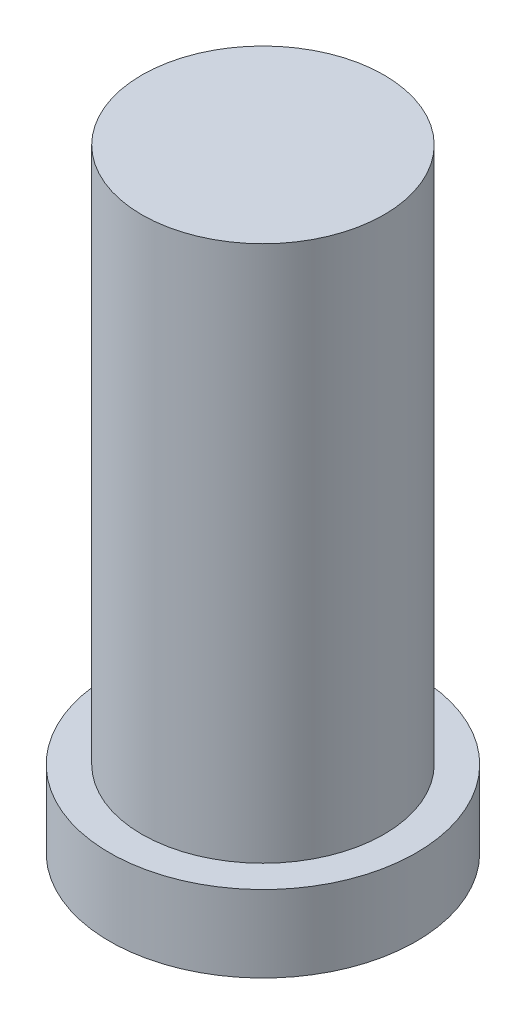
ISO-10303-21;
HEADER;
FILE_DESCRIPTION(('STEP AP214'),'2;1');
FILE_NAME('part.step','',(''),(''),'','','');
FILE_SCHEMA(('AUTOMOTIVE_DESIGN { 1 0 10303 214 1 1 1 1 }'));
ENDSEC;
DATA;
#1=APPLICATION_CONTEXT('core data for automotive mechanical design processes');
#2=APPLICATION_PROTOCOL_DEFINITION('international standard','automotive_design',2000,#1);
#3=PRODUCT_CONTEXT('',#1,'mechanical');
#4=PRODUCT('Part','Part','',(#3));
#5=PRODUCT_RELATED_PRODUCT_CATEGORY('part','',(#4));
#6=PRODUCT_DEFINITION_FORMATION('','',#4);
#7=PRODUCT_DEFINITION_CONTEXT('part definition',#1,'design');
#8=PRODUCT_DEFINITION('design','',#6,#7);
#9=PRODUCT_DEFINITION_SHAPE('','',#8);
#10=(LENGTH_UNIT() NAMED_UNIT(*) SI_UNIT(.MILLI.,.METRE.));
#11=(NAMED_UNIT(*) PLANE_ANGLE_UNIT() SI_UNIT($,.RADIAN.));
#12=(NAMED_UNIT(*) SI_UNIT($,.STERADIAN.) SOLID_ANGLE_UNIT());
#13=UNCERTAINTY_MEASURE_WITH_UNIT(LENGTH_MEASURE(1.E-05),#10,'distance_accuracy_value','');
#14=(GEOMETRIC_REPRESENTATION_CONTEXT(3) GLOBAL_UNCERTAINTY_ASSIGNED_CONTEXT((#13)) GLOBAL_UNIT_ASSIGNED_CONTEXT((#10,
#11,#12)) REPRESENTATION_CONTEXT('',''));
#15=CARTESIAN_POINT('',(0.,0.,0.));
#16=DIRECTION('',(0.,0.,1.));
#17=DIRECTION('',(1.,0.,0.));
#18=AXIS2_PLACEMENT_3D('',#15,#16,#17);
#19=CARTESIAN_POINT('',(-5.076698,25.4,-5.076698));
#20=DIRECTION('',(0.,1.,0.));
#21=DIRECTION('',(0.,0.,1.));
#22=AXIS2_PLACEMENT_3D('',#19,#20,#21);
#23=PLANE('',#22);
#24=CARTESIAN_POINT('',(0.,25.4,0.));
#25=DIRECTION('',(0.,-1.,0.));
#26=DIRECTION('',(0.,0.,-1.));
#27=AXIS2_PLACEMENT_3D('',#24,#25,#26);
#28=CIRCLE('',#27,5.0165);
#29=CARTESIAN_POINT('',(0.,25.4,-5.0165));
#30=VERTEX_POINT('',#29);
#31=EDGE_CURVE('E20',#30,#30,#28,.F.);
#32=ORIENTED_EDGE('',*,*,#31,.T.);
#33=EDGE_LOOP('',(#32));
#34=FACE_BOUND('',#33,.T.);
#35=ADVANCED_FACE('F16',(#34),#23,.T.);
#36=CARTESIAN_POINT('',(0.,25.4,0.));
#37=DIRECTION('',(0.,-1.,0.));
#38=DIRECTION('',(0.,0.,-1.));
#39=AXIS2_PLACEMENT_3D('',#36,#37,#38);
#40=CYLINDRICAL_SURFACE('',#39,5.0165);
#41=CARTESIAN_POINT('',(0.,3.175,0.));
#42=DIRECTION('',(0.,-1.,0.));
#43=DIRECTION('',(0.,0.,-1.));
#44=AXIS2_PLACEMENT_3D('',#41,#42,#43);
#45=CIRCLE('',#44,5.0165);
#46=CARTESIAN_POINT('',(0.,3.175,-5.0165));
#47=VERTEX_POINT('',#46);
#48=EDGE_CURVE('E43',#47,#47,#45,.F.);
#49=ORIENTED_EDGE('',*,*,#48,.T.);
#50=EDGE_LOOP('',(#49));
#51=FACE_BOUND('',#50,.T.);
#52=ORIENTED_EDGE('',*,*,#31,.F.);
#53=EDGE_LOOP('',(#52));
#54=FACE_BOUND('',#53,.T.);
#55=ADVANCED_FACE('F51',(#51,#54),#40,.T.);
#56=CARTESIAN_POINT('',(-6.4262,3.175,6.4262));
#57=DIRECTION('',(0.,-1.,0.));
#58=DIRECTION('',(0.,0.,-1.));
#59=AXIS2_PLACEMENT_3D('',#56,#57,#58);
#60=PLANE('',#59);
#61=ORIENTED_EDGE('',*,*,#48,.F.);
#62=EDGE_LOOP('',(#61));
#63=FACE_BOUND('',#62,.T.);
#64=CARTESIAN_POINT('',(0.,3.175,0.));
#65=DIRECTION('',(0.,-1.,0.));
#66=DIRECTION('',(0.,0.,-1.));
#67=AXIS2_PLACEMENT_3D('',#64,#65,#66);
#68=CIRCLE('',#67,6.35);
#69=CARTESIAN_POINT('',(0.,3.175,-6.35));
#70=VERTEX_POINT('',#69);
#71=EDGE_CURVE('E39',#70,#70,#68,.F.);
#72=ORIENTED_EDGE('',*,*,#71,.T.);
#73=EDGE_LOOP('',(#72));
#74=FACE_BOUND('',#73,.T.);
#75=ADVANCED_FACE('F53',(#63,#74),#60,.F.);
#76=CARTESIAN_POINT('',(0.,3.175,0.));
#77=DIRECTION('',(0.,-1.,0.));
#78=DIRECTION('',(0.,0.,-1.));
#79=AXIS2_PLACEMENT_3D('',#76,#77,#78);
#80=CYLINDRICAL_SURFACE('',#79,6.35);
#81=CARTESIAN_POINT('',(0.,0.,0.));
#82=DIRECTION('',(0.,-1.,0.));
#83=DIRECTION('',(0.,0.,-1.));
#84=AXIS2_PLACEMENT_3D('',#81,#82,#83);
#85=CIRCLE('',#84,6.35);
#86=CARTESIAN_POINT('',(0.,0.,-6.35));
#87=VERTEX_POINT('',#86);
#88=EDGE_CURVE('E36',#87,#87,#85,.F.);
#89=ORIENTED_EDGE('',*,*,#88,.T.);
#90=EDGE_LOOP('',(#89));
#91=FACE_BOUND('',#90,.T.);
#92=ORIENTED_EDGE('',*,*,#71,.F.);
#93=EDGE_LOOP('',(#92));
#94=FACE_BOUND('',#93,.T.);
#95=ADVANCED_FACE('F31',(#91,#94),#80,.T.);
#96=CARTESIAN_POINT('',(0.,24.3938168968,0.));
#97=DIRECTION('',(0.,-1.,0.));
#98=DIRECTION('',(1.,0.,0.));
#99=AXIS2_PLACEMENT_3D('',#96,#97,#98);
#100=CONICAL_SURFACE('',#99,0.,1.02974426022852);
#101=CARTESIAN_POINT('',(0.,24.3938168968,0.));
#102=VERTEX_POINT('',#101);
#103=VERTEX_LOOP('',#102);
#104=FACE_BOUND('',#103,.T.);
#105=CARTESIAN_POINT('',(0.,22.86,0.));
#106=DIRECTION('',(0.,-1.,0.));
#107=DIRECTION('',(0.,0.,-1.));
#108=AXIS2_PLACEMENT_3D('',#105,#106,#107);
#109=CIRCLE('',#108,2.5527);
#110=CARTESIAN_POINT('',(0.,22.86,-2.5527));
#111=VERTEX_POINT('',#110);
#112=EDGE_CURVE('E24',#111,#111,#109,.F.);
#113=ORIENTED_EDGE('',*,*,#112,.F.);
#114=EDGE_LOOP('',(#113));
#115=FACE_BOUND('',#114,.T.);
#116=ADVANCED_FACE('F28',(#104,#115),#100,.F.);
#117=CARTESIAN_POINT('',(-6.4262,0.,-6.4262));
#118=DIRECTION('',(0.,1.,0.));
#119=DIRECTION('',(0.,0.,1.));
#120=AXIS2_PLACEMENT_3D('',#117,#118,#119);
#121=PLANE('',#120);
#122=CARTESIAN_POINT('',(0.,0.,0.));
#123=DIRECTION('',(0.,-1.,0.));
#124=DIRECTION('',(1.,0.,0.));
#125=AXIS2_PLACEMENT_3D('',#122,#123,#124);
#126=CIRCLE('',#125,2.5527);
#127=CARTESIAN_POINT('',(2.55269999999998,0.,0.));
#128=VERTEX_POINT('',#127);
#129=EDGE_CURVE('E10',#128,#128,#126,.T.);
#130=ORIENTED_EDGE('',*,*,#129,.F.);
#131=EDGE_LOOP('',(#130));
#132=FACE_BOUND('',#131,.T.);
#133=ORIENTED_EDGE('',*,*,#88,.F.);
#134=EDGE_LOOP('',(#133));
#135=FACE_BOUND('',#134,.T.);
#136=ADVANCED_FACE('F18',(#132,#135),#121,.F.);
#137=CARTESIAN_POINT('',(0.,22.86,0.));
#138=DIRECTION('',(0.,-1.,0.));
#139=DIRECTION('',(1.,0.,0.));
#140=AXIS2_PLACEMENT_3D('',#137,#138,#139);
#141=CYLINDRICAL_SURFACE('',#140,2.5527);
#142=ORIENTED_EDGE('',*,*,#129,.T.);
#143=EDGE_LOOP('',(#142));
#144=FACE_BOUND('',#143,.T.);
#145=ORIENTED_EDGE('',*,*,#112,.T.);
#146=EDGE_LOOP('',(#145));
#147=FACE_BOUND('',#146,.T.);
#148=ADVANCED_FACE('F63',(#144,#147),#141,.F.);
#149=CLOSED_SHELL('',(#35,#55,#75,#95,#116,#136,#148));
#150=MANIFOLD_SOLID_BREP('B1',#149);
#151=ADVANCED_BREP_SHAPE_REPRESENTATION('',(#18,#150),#14);
#152=SHAPE_DEFINITION_REPRESENTATION(#9,#151);
ENDSEC;
END-ISO-10303-21;
